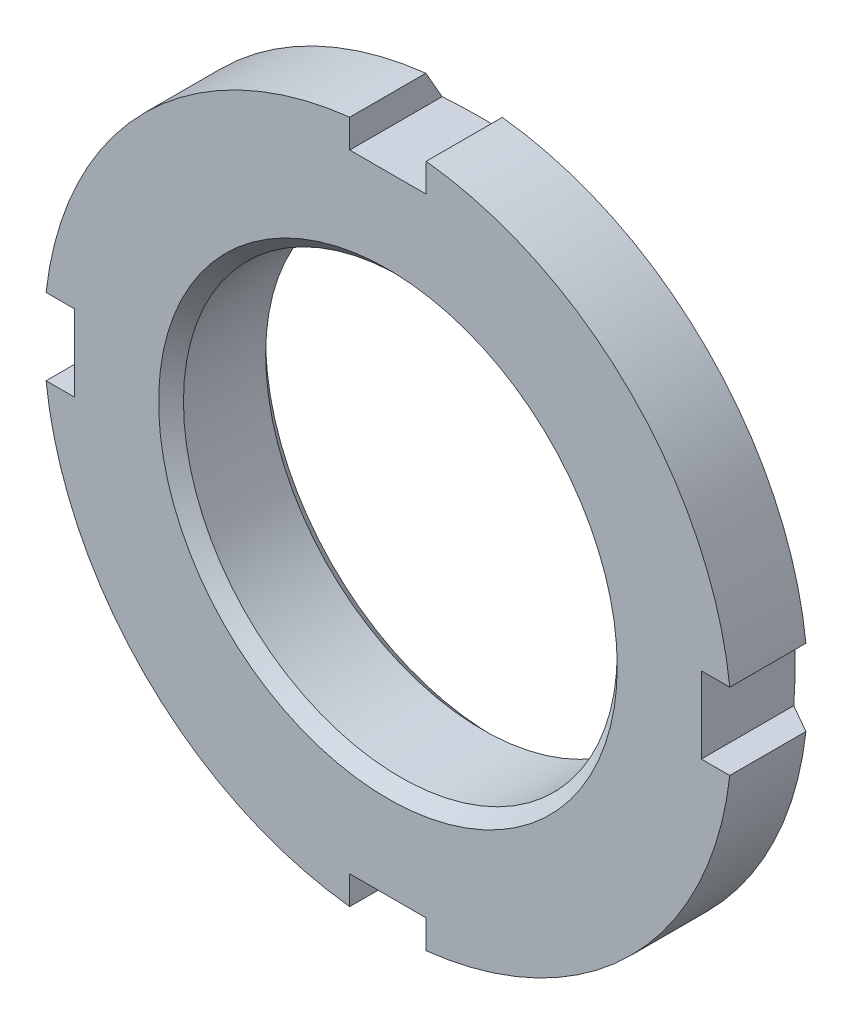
ISO-10303-21;
HEADER;
FILE_DESCRIPTION(('STEP AP214'),'2;1');
FILE_NAME('part.step','',(''),(''),'','','');
FILE_SCHEMA(('AUTOMOTIVE_DESIGN { 1 0 10303 214 1 1 1 1 }'));
ENDSEC;
DATA;
#1=APPLICATION_CONTEXT('core data for automotive mechanical design processes');
#2=APPLICATION_PROTOCOL_DEFINITION('international standard','automotive_design',2000,#1);
#3=PRODUCT_CONTEXT('',#1,'mechanical');
#4=PRODUCT('Part','Part','',(#3));
#5=PRODUCT_RELATED_PRODUCT_CATEGORY('part','',(#4));
#6=PRODUCT_DEFINITION_FORMATION('','',#4);
#7=PRODUCT_DEFINITION_CONTEXT('part definition',#1,'design');
#8=PRODUCT_DEFINITION('design','',#6,#7);
#9=PRODUCT_DEFINITION_SHAPE('','',#8);
#10=(LENGTH_UNIT() NAMED_UNIT(*) SI_UNIT(.MILLI.,.METRE.));
#11=(NAMED_UNIT(*) PLANE_ANGLE_UNIT() SI_UNIT($,.RADIAN.));
#12=(NAMED_UNIT(*) SI_UNIT($,.STERADIAN.) SOLID_ANGLE_UNIT());
#13=UNCERTAINTY_MEASURE_WITH_UNIT(LENGTH_MEASURE(1.E-05),#10,'distance_accuracy_value','');
#14=(GEOMETRIC_REPRESENTATION_CONTEXT(3) GLOBAL_UNCERTAINTY_ASSIGNED_CONTEXT((#13)) GLOBAL_UNIT_ASSIGNED_CONTEXT((#10,
#11,#12)) REPRESENTATION_CONTEXT('',''));
#15=CARTESIAN_POINT('',(0.,0.,0.));
#16=DIRECTION('',(0.,0.,1.));
#17=DIRECTION('',(1.,0.,0.));
#18=AXIS2_PLACEMENT_3D('',#15,#16,#17);
#19=CARTESIAN_POINT('',(0.,0.,-7.));
#20=DIRECTION('',(0.,0.,1.));
#21=DIRECTION('',(1.,0.,0.));
#22=AXIS2_PLACEMENT_3D('',#19,#20,#21);
#23=CYLINDRICAL_SURFACE('',#22,22.5);
#24=DIRECTION('',(0.,0.,1.));
#25=VECTOR('',#24,1.);
#26=CARTESIAN_POINT('',(-2.5,22.3606797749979,-7.));
#27=LINE('',#26,#25);
#28=CARTESIAN_POINT('',(-2.5,22.3606797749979,-4.9792740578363));
#29=VERTEX_POINT('',#28);
#30=CARTESIAN_POINT('',(-2.5,22.3606797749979,0.));
#31=VERTEX_POINT('',#30);
#32=EDGE_CURVE('E263',#29,#31,#27,.T.);
#33=ORIENTED_EDGE('',*,*,#32,.F.);
#34=CARTESIAN_POINT('',(0.,0.,-4.9792740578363));
#35=DIRECTION('',(0.,0.,1.));
#36=DIRECTION('',(1.,0.,0.));
#37=AXIS2_PLACEMENT_3D('',#34,#35,#36);
#38=CIRCLE('',#37,22.5);
#39=CARTESIAN_POINT('',(-22.3606797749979,2.5,-4.9792740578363));
#40=VERTEX_POINT('',#39);
#41=EDGE_CURVE('E271',#29,#40,#38,.T.);
#42=ORIENTED_EDGE('',*,*,#41,.T.);
#43=DIRECTION('',(0.,0.,1.));
#44=VECTOR('',#43,1.);
#45=CARTESIAN_POINT('',(-22.3606797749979,2.5,-7.));
#46=LINE('',#45,#44);
#47=CARTESIAN_POINT('',(-22.3606797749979,2.5,0.));
#48=VERTEX_POINT('',#47);
#49=EDGE_CURVE('E233',#48,#40,#46,.F.);
#50=ORIENTED_EDGE('',*,*,#49,.F.);
#51=CARTESIAN_POINT('',(0.,0.,0.));
#52=DIRECTION('',(0.,0.,1.));
#53=DIRECTION('',(1.,0.,0.));
#54=AXIS2_PLACEMENT_3D('',#51,#52,#53);
#55=CIRCLE('',#54,22.5);
#56=EDGE_CURVE('E196',#31,#48,#55,.T.);
#57=ORIENTED_EDGE('',*,*,#56,.F.);
#58=EDGE_LOOP('',(#33,#42,#50,#57));
#59=FACE_BOUND('',#58,.T.);
#60=ADVANCED_FACE('F39',(#59),#23,.T.);
#61=DIRECTION('',(0.,0.,1.));
#62=VECTOR('',#61,1.);
#63=CARTESIAN_POINT('',(2.5,22.3606797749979,-7.));
#64=LINE('',#63,#62);
#65=CARTESIAN_POINT('',(2.5,22.3606797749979,0.));
#66=VERTEX_POINT('',#65);
#67=CARTESIAN_POINT('',(2.5,22.3606797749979,-4.9792740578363));
#68=VERTEX_POINT('',#67);
#69=EDGE_CURVE('E261',#66,#68,#64,.F.);
#70=ORIENTED_EDGE('',*,*,#69,.F.);
#71=CARTESIAN_POINT('',(22.3606797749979,2.5,0.));
#72=VERTEX_POINT('',#71);
#73=EDGE_CURVE('E292',#72,#66,#55,.T.);
#74=ORIENTED_EDGE('',*,*,#73,.F.);
#75=DIRECTION('',(0.,0.,1.));
#76=VECTOR('',#75,1.);
#77=CARTESIAN_POINT('',(22.3606797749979,2.5,-7.));
#78=LINE('',#77,#76);
#79=CARTESIAN_POINT('',(22.3606797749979,2.5,-4.9792740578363));
#80=VERTEX_POINT('',#79);
#81=EDGE_CURVE('E258',#80,#72,#78,.T.);
#82=ORIENTED_EDGE('',*,*,#81,.F.);
#83=EDGE_CURVE('E266',#80,#68,#38,.T.);
#84=ORIENTED_EDGE('',*,*,#83,.T.);
#85=EDGE_LOOP('',(#70,#74,#82,#84));
#86=FACE_BOUND('',#85,.T.);
#87=ADVANCED_FACE('F452',(#86),#23,.T.);
#88=DIRECTION('',(0.,0.,1.));
#89=VECTOR('',#88,1.);
#90=CARTESIAN_POINT('',(22.3606797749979,-2.5,-7.));
#91=LINE('',#90,#89);
#92=CARTESIAN_POINT('',(22.3606797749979,-2.5,0.));
#93=VERTEX_POINT('',#92);
#94=CARTESIAN_POINT('',(22.3606797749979,-2.5,-4.9792740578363));
#95=VERTEX_POINT('',#94);
#96=EDGE_CURVE('E61',#93,#95,#91,.F.);
#97=ORIENTED_EDGE('',*,*,#96,.F.);
#98=CARTESIAN_POINT('',(2.5,-22.3606797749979,0.));
#99=VERTEX_POINT('',#98);
#100=EDGE_CURVE('E291',#99,#93,#55,.T.);
#101=ORIENTED_EDGE('',*,*,#100,.F.);
#102=DIRECTION('',(0.,0.,1.));
#103=VECTOR('',#102,1.);
#104=CARTESIAN_POINT('',(2.5,-22.3606797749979,-7.));
#105=LINE('',#104,#103);
#106=CARTESIAN_POINT('',(2.5,-22.3606797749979,-4.9792740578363));
#107=VERTEX_POINT('',#106);
#108=EDGE_CURVE('E254',#107,#99,#105,.T.);
#109=ORIENTED_EDGE('',*,*,#108,.F.);
#110=EDGE_CURVE('E265',#107,#95,#38,.T.);
#111=ORIENTED_EDGE('',*,*,#110,.T.);
#112=EDGE_LOOP('',(#97,#101,#109,#111));
#113=FACE_BOUND('',#112,.T.);
#114=ADVANCED_FACE('F429',(#113),#23,.T.);
#115=DIRECTION('',(0.,0.,1.));
#116=VECTOR('',#115,1.);
#117=CARTESIAN_POINT('',(-2.5,-22.3606797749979,-7.));
#118=LINE('',#117,#116);
#119=CARTESIAN_POINT('',(-2.5,-22.3606797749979,0.));
#120=VERTEX_POINT('',#119);
#121=CARTESIAN_POINT('',(-2.5,-22.3606797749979,-4.9792740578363));
#122=VERTEX_POINT('',#121);
#123=EDGE_CURVE('E69',#120,#122,#118,.F.);
#124=ORIENTED_EDGE('',*,*,#123,.F.);
#125=CARTESIAN_POINT('',(-22.3606797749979,-2.5,0.));
#126=VERTEX_POINT('',#125);
#127=EDGE_CURVE('E419',#126,#120,#55,.T.);
#128=ORIENTED_EDGE('',*,*,#127,.F.);
#129=DIRECTION('',(0.,0.,1.));
#130=VECTOR('',#129,1.);
#131=CARTESIAN_POINT('',(-22.3606797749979,-2.5,-7.));
#132=LINE('',#131,#130);
#133=CARTESIAN_POINT('',(-22.3606797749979,-2.5,-4.9792740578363));
#134=VERTEX_POINT('',#133);
#135=EDGE_CURVE('E250',#134,#126,#132,.T.);
#136=ORIENTED_EDGE('',*,*,#135,.F.);
#137=EDGE_CURVE('E434',#134,#122,#38,.T.);
#138=ORIENTED_EDGE('',*,*,#137,.T.);
#139=EDGE_LOOP('',(#124,#128,#136,#138));
#140=FACE_BOUND('',#139,.T.);
#141=ADVANCED_FACE('F442',(#140),#23,.T.);
#142=CARTESIAN_POINT('',(0.,22.5,0.));
#143=DIRECTION('',(0.,0.,-1.));
#144=DIRECTION('',(-1.,0.,0.));
#145=AXIS2_PLACEMENT_3D('',#142,#143,#144);
#146=PLANE('',#145);
#147=CARTESIAN_POINT('',(0.,0.,0.));
#148=DIRECTION('',(0.,0.,1.));
#149=DIRECTION('',(1.,0.,0.));
#150=AXIS2_PLACEMENT_3D('',#147,#148,#149);
#151=CIRCLE('',#150,15.);
#152=CARTESIAN_POINT('',(15.,0.,0.));
#153=VERTEX_POINT('',#152);
#154=EDGE_CURVE('E287',#153,#153,#151,.T.);
#155=ORIENTED_EDGE('',*,*,#154,.F.);
#156=EDGE_LOOP('',(#155));
#157=FACE_BOUND('',#156,.T.);
#158=DIRECTION('',(0.,1.,0.));
#159=VECTOR('',#158,1.);
#160=CARTESIAN_POINT('',(-2.5,20.5,0.));
#161=LINE('',#160,#159);
#162=CARTESIAN_POINT('',(-2.5,20.5,0.));
#163=VERTEX_POINT('',#162);
#164=EDGE_CURVE('E180',#163,#31,#161,.T.);
#165=ORIENTED_EDGE('',*,*,#164,.T.);
#166=ORIENTED_EDGE('',*,*,#56,.T.);
#167=DIRECTION('',(1.,0.,0.));
#168=VECTOR('',#167,1.);
#169=CARTESIAN_POINT('',(-34.52498880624,2.5,0.));
#170=LINE('',#169,#168);
#171=CARTESIAN_POINT('',(-20.5,2.5,0.));
#172=VERTEX_POINT('',#171);
#173=EDGE_CURVE('E172',#48,#172,#170,.T.);
#174=ORIENTED_EDGE('',*,*,#173,.T.);
#175=DIRECTION('',(0.,-1.,0.));
#176=VECTOR('',#175,1.);
#177=CARTESIAN_POINT('',(-20.5,2.5,0.));
#178=LINE('',#177,#176);
#179=CARTESIAN_POINT('',(-20.5,-2.5,0.));
#180=VERTEX_POINT('',#179);
#181=EDGE_CURVE('E183',#172,#180,#178,.T.);
#182=ORIENTED_EDGE('',*,*,#181,.T.);
#183=DIRECTION('',(-1.,0.,0.));
#184=VECTOR('',#183,1.);
#185=CARTESIAN_POINT('',(-20.5,-2.5,0.));
#186=LINE('',#185,#184);
#187=EDGE_CURVE('E190',#180,#126,#186,.T.);
#188=ORIENTED_EDGE('',*,*,#187,.T.);
#189=ORIENTED_EDGE('',*,*,#127,.T.);
#190=DIRECTION('',(0.,1.,0.));
#191=VECTOR('',#190,1.);
#192=CARTESIAN_POINT('',(-2.5,-34.52498880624,0.));
#193=LINE('',#192,#191);
#194=CARTESIAN_POINT('',(-2.5,-20.5,0.));
#195=VERTEX_POINT('',#194);
#196=EDGE_CURVE('E203',#120,#195,#193,.T.);
#197=ORIENTED_EDGE('',*,*,#196,.T.);
#198=DIRECTION('',(1.,0.,0.));
#199=VECTOR('',#198,1.);
#200=CARTESIAN_POINT('',(-2.5,-20.5,0.));
#201=LINE('',#200,#199);
#202=CARTESIAN_POINT('',(2.5,-20.5,0.));
#203=VERTEX_POINT('',#202);
#204=EDGE_CURVE('E206',#195,#203,#201,.T.);
#205=ORIENTED_EDGE('',*,*,#204,.T.);
#206=DIRECTION('',(0.,-1.,0.));
#207=VECTOR('',#206,1.);
#208=CARTESIAN_POINT('',(2.5,-20.5,0.));
#209=LINE('',#208,#207);
#210=EDGE_CURVE('E209',#203,#99,#209,.T.);
#211=ORIENTED_EDGE('',*,*,#210,.T.);
#212=ORIENTED_EDGE('',*,*,#100,.T.);
#213=DIRECTION('',(-1.,0.,0.));
#214=VECTOR('',#213,1.);
#215=CARTESIAN_POINT('',(34.52498880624,-2.5,0.));
#216=LINE('',#215,#214);
#217=CARTESIAN_POINT('',(20.5,-2.5,0.));
#218=VERTEX_POINT('',#217);
#219=EDGE_CURVE('E212',#93,#218,#216,.T.);
#220=ORIENTED_EDGE('',*,*,#219,.T.);
#221=DIRECTION('',(0.,1.,0.));
#222=VECTOR('',#221,1.);
#223=CARTESIAN_POINT('',(20.5,-2.5,0.));
#224=LINE('',#223,#222);
#225=CARTESIAN_POINT('',(20.5,2.5,0.));
#226=VERTEX_POINT('',#225);
#227=EDGE_CURVE('E216',#218,#226,#224,.T.);
#228=ORIENTED_EDGE('',*,*,#227,.T.);
#229=DIRECTION('',(1.,0.,0.));
#230=VECTOR('',#229,1.);
#231=CARTESIAN_POINT('',(20.5,2.5,0.));
#232=LINE('',#231,#230);
#233=EDGE_CURVE('E220',#226,#72,#232,.T.);
#234=ORIENTED_EDGE('',*,*,#233,.T.);
#235=ORIENTED_EDGE('',*,*,#73,.T.);
#236=DIRECTION('',(0.,-1.,0.));
#237=VECTOR('',#236,1.);
#238=CARTESIAN_POINT('',(2.5,34.52498880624,0.));
#239=LINE('',#238,#237);
#240=CARTESIAN_POINT('',(2.5,20.5,0.));
#241=VERTEX_POINT('',#240);
#242=EDGE_CURVE('E224',#66,#241,#239,.T.);
#243=ORIENTED_EDGE('',*,*,#242,.T.);
#244=DIRECTION('',(-1.,0.,0.));
#245=VECTOR('',#244,1.);
#246=CARTESIAN_POINT('',(2.5,20.5,0.));
#247=LINE('',#246,#245);
#248=EDGE_CURVE('E227',#241,#163,#247,.T.);
#249=ORIENTED_EDGE('',*,*,#248,.T.);
#250=EDGE_LOOP('',(#165,#166,#174,#182,#188,#189,#197,#205,#211,#212,#220,#228,#234,#235,#243,#249));
#251=FACE_BOUND('',#250,.T.);
#252=ADVANCED_FACE('F194',(#157,#251),#146,.F.);
#253=CARTESIAN_POINT('',(0.,0.,-7.));
#254=DIRECTION('',(0.,0.,1.));
#255=DIRECTION('',(1.,0.,0.));
#256=AXIS2_PLACEMENT_3D('',#253,#254,#255);
#257=CONICAL_SURFACE('',#256,19.,1.0471975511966);
#258=CARTESIAN_POINT('',(0.,0.,-7.));
#259=DIRECTION('',(0.,0.,1.));
#260=DIRECTION('',(1.,0.,0.));
#261=AXIS2_PLACEMENT_3D('',#258,#259,#260);
#262=CIRCLE('',#261,19.);
#263=CARTESIAN_POINT('',(19.,0.,-7.));
#264=VERTEX_POINT('',#263);
#265=EDGE_CURVE('E270',#264,#264,#262,.T.);
#266=ORIENTED_EDGE('',*,*,#265,.T.);
#267=EDGE_LOOP('',(#266));
#268=FACE_BOUND('',#267,.T.);
#269=CARTESIAN_POINT('',(-2.5,16.1512451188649,-8.53368282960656));
#270=CARTESIAN_POINT('',(-2.5,16.8937621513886,-8.11000639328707));
#271=CARTESIAN_POINT('',(-2.5,17.6360109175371,-7.68586039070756));
#272=CARTESIAN_POINT('',(-2.5,19.1200996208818,-6.83685454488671));
#273=CARTESIAN_POINT('',(-2.5,19.8619395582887,-6.41199470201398));
#274=CARTESIAN_POINT('',(-2.5,21.3453388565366,-5.56178615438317));
#275=CARTESIAN_POINT('',(-2.5,22.08689821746,-5.13643744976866));
#276=CARTESIAN_POINT('',(-2.5,23.5698031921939,-4.28536671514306));
#277=CARTESIAN_POINT('',(-2.5,24.3111488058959,-3.85964468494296));
#278=CARTESIAN_POINT('',(-2.5,25.0524204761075,-3.43379403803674));
#279=B_SPLINE_CURVE_WITH_KNOTS('',3,(#269,#270,#271,#272,#273,#274,#275,#276,#277,#278),
.UNSPECIFIED.,.F.,.F.,(4,2,2,2,4),(0.,2.56466301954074,5.12932471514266,7.69398565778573,
10.2586478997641),.UNSPECIFIED.);
#280=CARTESIAN_POINT('',(-2.5,20.5,-6.0462886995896));
#281=VERTEX_POINT('',#280);
#282=EDGE_CURVE('E11',#281,#29,#279,.T.);
#283=ORIENTED_EDGE('',*,*,#282,.F.);
#284=CARTESIAN_POINT('',(9.04404011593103,20.5,-5.03334109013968));
#285=CARTESIAN_POINT('',(8.59429321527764,20.5,-5.13815943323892));
#286=CARTESIAN_POINT('',(8.14305919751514,20.5,-5.23676310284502));
#287=CARTESIAN_POINT('',(7.23773580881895,20.5,-5.42034749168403));
#288=CARTESIAN_POINT('',(6.78364585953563,20.5,-5.50532535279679));
#289=CARTESIAN_POINT('',(5.87243627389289,20.5,-5.66050164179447));
#290=CARTESIAN_POINT('',(5.41531394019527,20.5,-5.73068433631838));
#291=CARTESIAN_POINT('',(4.49891675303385,20.5,-5.85503635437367));
#292=CARTESIAN_POINT('',(4.03964204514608,20.5,-5.90920674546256));
#293=CARTESIAN_POINT('',(3.12828446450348,20.5,-5.99971235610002));
#294=CARTESIAN_POINT('',(2.67623393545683,20.5,-6.0363717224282));
#295=CARTESIAN_POINT('',(1.7710645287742,20.5,-6.09272736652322));
#296=CARTESIAN_POINT('',(1.31794563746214,20.5,-6.11242342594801));
#297=CARTESIAN_POINT('',(0.411577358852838,20.5,-6.1344741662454));
#298=CARTESIAN_POINT('',(-0.0416717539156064,20.5,-6.13684006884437));
#299=CARTESIAN_POINT('',(-0.947924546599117,20.5,-6.12421501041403));
#300=CARTESIAN_POINT('',(-1.40092822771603,20.5,-6.10922413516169));
#301=CARTESIAN_POINT('',(-2.30461841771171,20.5,-6.06224315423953));
#302=CARTESIAN_POINT('',(-2.75530773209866,20.5,-6.03030670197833));
#303=CARTESIAN_POINT('',(-3.65521888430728,20.5,-5.95004659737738));
#304=CARTESIAN_POINT('',(-4.10444071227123,20.5,-5.90172283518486));
#305=CARTESIAN_POINT('',(-5.00125431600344,20.5,-5.78946937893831));
#306=CARTESIAN_POINT('',(-5.4488446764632,20.5,-5.72552841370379));
#307=CARTESIAN_POINT('',(-6.34170940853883,20.5,-5.58306139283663));
#308=CARTESIAN_POINT('',(-6.78698359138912,20.5,-5.50453416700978));
#309=CARTESIAN_POINT('',(-8.13663816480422,20.5,-5.24532615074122));
#310=CARTESIAN_POINT('',(-9.03699225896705,20.5,-5.04332605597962));
#311=CARTESIAN_POINT('',(-10.3777295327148,20.5,-4.7058496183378));
#312=CARTESIAN_POINT('',(-10.8226389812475,20.5,-4.58772539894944));
#313=CARTESIAN_POINT('',(-11.7094932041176,20.5,-4.34111167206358));
#314=CARTESIAN_POINT('',(-12.1514385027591,20.5,-4.212624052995));
#315=CARTESIAN_POINT('',(-12.5920022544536,20.5,-4.07950847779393));
#316=B_SPLINE_CURVE_WITH_KNOTS('',3,(#284,#285,#286,#287,#288,#289,#290,#291,#292,#293,#294,
#295,#296,#297,#298,#299,#300,#301,#302,#303,#304,#305,#306,#307,#308,#309,#310,#311,#312,#313,
#314,#315),.UNSPECIFIED.,.F.,.F.,(4,2,2,2,2,2,2,2,2,2,2,2,2,2,2,4),(0.,1.38541175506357,
2.77111373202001,4.1582819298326,5.54535762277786,6.90565342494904,8.26596673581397,
9.62539913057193,10.9848248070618,12.339971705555,13.6951276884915,15.0512646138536,
16.4075103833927,19.1739270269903,20.5548108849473,21.9354436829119),.UNSPECIFIED.);
#317=CARTESIAN_POINT('',(2.5,20.5,-6.0462886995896));
#318=VERTEX_POINT('',#317);
#319=EDGE_CURVE('E51',#318,#281,#316,.T.);
#320=ORIENTED_EDGE('',*,*,#319,.F.);
#321=CARTESIAN_POINT('',(2.5,25.0524204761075,-3.43379403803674));
#322=CARTESIAN_POINT('',(2.5,24.3111488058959,-3.85964468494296));
#323=CARTESIAN_POINT('',(2.5,23.5698031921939,-4.28536671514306));
#324=CARTESIAN_POINT('',(2.5,22.08689821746,-5.13643744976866));
#325=CARTESIAN_POINT('',(2.5,21.3453388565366,-5.56178615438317));
#326=CARTESIAN_POINT('',(2.5,19.8619395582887,-6.41199470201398));
#327=CARTESIAN_POINT('',(2.5,19.1200996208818,-6.83685454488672));
#328=CARTESIAN_POINT('',(2.5,17.6360109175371,-7.68586039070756));
#329=CARTESIAN_POINT('',(2.5,16.8937621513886,-8.11000639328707));
#330=CARTESIAN_POINT('',(2.5,16.1512451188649,-8.53368282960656));
#331=B_SPLINE_CURVE_WITH_KNOTS('',3,(#321,#322,#323,#324,#325,#326,#327,#328,#329,#330),
.UNSPECIFIED.,.F.,.F.,(4,2,2,2,4),(0.,2.56466224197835,5.12932318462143,7.69398488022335,
10.2586478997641),.UNSPECIFIED.);
#332=EDGE_CURVE('E381',#68,#318,#331,.T.);
#333=ORIENTED_EDGE('',*,*,#332,.F.);
#334=ORIENTED_EDGE('',*,*,#83,.F.);
#335=CARTESIAN_POINT('',(16.1512451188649,2.5,-8.53368282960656));
#336=CARTESIAN_POINT('',(16.8937621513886,2.5,-8.11000639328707));
#337=CARTESIAN_POINT('',(17.6360109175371,2.5,-7.68586039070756));
#338=CARTESIAN_POINT('',(19.1200996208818,2.5,-6.83685454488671));
#339=CARTESIAN_POINT('',(19.8619395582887,2.5,-6.41199470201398));
#340=CARTESIAN_POINT('',(21.3453388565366,2.5,-5.56178615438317));
#341=CARTESIAN_POINT('',(22.08689821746,2.5,-5.13643744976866));
#342=CARTESIAN_POINT('',(23.5698031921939,2.5,-4.28536671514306));
#343=CARTESIAN_POINT('',(24.3111488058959,2.5,-3.85964468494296));
#344=CARTESIAN_POINT('',(25.0524204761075,2.5,-3.43379403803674));
#345=B_SPLINE_CURVE_WITH_KNOTS('',3,(#335,#336,#337,#338,#339,#340,#341,#342,#343,#344),
.UNSPECIFIED.,.F.,.F.,(4,2,2,2,4),(0.,2.56466301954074,5.12932471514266,7.69398565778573,
10.2586478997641),.UNSPECIFIED.);
#346=CARTESIAN_POINT('',(20.5,2.5,-6.0462886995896));
#347=VERTEX_POINT('',#346);
#348=EDGE_CURVE('E375',#347,#80,#345,.T.);
#349=ORIENTED_EDGE('',*,*,#348,.F.);
#350=CARTESIAN_POINT('',(20.5,-12.5920022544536,-4.07950847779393));
#351=CARTESIAN_POINT('',(20.5,-12.1514385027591,-4.212624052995));
#352=CARTESIAN_POINT('',(20.5,-11.7094932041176,-4.34111167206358));
#353=CARTESIAN_POINT('',(20.5,-10.8226389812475,-4.58772539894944));
#354=CARTESIAN_POINT('',(20.5,-10.3777295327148,-4.7058496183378));
#355=CARTESIAN_POINT('',(20.5,-9.03699225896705,-5.04332605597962));
#356=CARTESIAN_POINT('',(20.5,-8.13663816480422,-5.24532615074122));
#357=CARTESIAN_POINT('',(20.5,-6.78698359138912,-5.50453416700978));
#358=CARTESIAN_POINT('',(20.5,-6.34170940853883,-5.58306139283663));
#359=CARTESIAN_POINT('',(20.5,-5.4488446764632,-5.72552841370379));
#360=CARTESIAN_POINT('',(20.5,-5.00125431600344,-5.78946937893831));
#361=CARTESIAN_POINT('',(20.5,-4.10444071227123,-5.90172283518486));
#362=CARTESIAN_POINT('',(20.5,-3.65521888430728,-5.95004659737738));
#363=CARTESIAN_POINT('',(20.5,-2.75530773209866,-6.03030670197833));
#364=CARTESIAN_POINT('',(20.5,-2.3046184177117,-6.06224315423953));
#365=CARTESIAN_POINT('',(20.5,-1.40092822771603,-6.10922413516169));
#366=CARTESIAN_POINT('',(20.5,-0.947924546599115,-6.12421501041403));
#367=CARTESIAN_POINT('',(20.5,-0.0416717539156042,-6.13684006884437));
#368=CARTESIAN_POINT('',(20.5,0.41157735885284,-6.1344741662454));
#369=CARTESIAN_POINT('',(20.5,1.31794563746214,-6.11242342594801));
#370=CARTESIAN_POINT('',(20.5,1.7710645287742,-6.09272736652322));
#371=CARTESIAN_POINT('',(20.5,2.67623393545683,-6.0363717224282));
#372=CARTESIAN_POINT('',(20.5,3.12828446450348,-5.99971235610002));
#373=CARTESIAN_POINT('',(20.5,4.03964204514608,-5.90920674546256));
#374=CARTESIAN_POINT('',(20.5,4.49891675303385,-5.85503635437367));
#375=CARTESIAN_POINT('',(20.5,5.41531394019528,-5.73068433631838));
#376=CARTESIAN_POINT('',(20.5,5.87243627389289,-5.66050164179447));
#377=CARTESIAN_POINT('',(20.5,6.78364585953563,-5.50532535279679));
#378=CARTESIAN_POINT('',(20.5,7.23773580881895,-5.42034749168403));
#379=CARTESIAN_POINT('',(20.5,8.14305919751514,-5.23676310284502));
#380=CARTESIAN_POINT('',(20.5,8.59429321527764,-5.13815943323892));
#381=CARTESIAN_POINT('',(20.5,9.04404011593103,-5.03334109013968));
#382=B_SPLINE_CURVE_WITH_KNOTS('',3,(#350,#351,#352,#353,#354,#355,#356,#357,#358,#359,#360,
#361,#362,#363,#364,#365,#366,#367,#368,#369,#370,#371,#372,#373,#374,#375,#376,#377,#378,#379,
#380,#381),.UNSPECIFIED.,.F.,.F.,(4,2,2,2,2,2,2,2,2,2,2,2,2,2,2,4),(0.,1.3806327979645,
2.7615166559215,5.52793329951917,6.88417906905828,8.24031599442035,9.5954719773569,
10.95061887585,12.3100445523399,13.6694769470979,15.0297902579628,16.390086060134,
17.7771617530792,19.1643299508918,20.5500319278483,21.9354436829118),.UNSPECIFIED.);
#383=CARTESIAN_POINT('',(20.5,-2.5,-6.0462886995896));
#384=VERTEX_POINT('',#383);
#385=EDGE_CURVE('E369',#384,#347,#382,.T.);
#386=ORIENTED_EDGE('',*,*,#385,.F.);
#387=CARTESIAN_POINT('',(25.0524204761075,-2.5,-3.43379403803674));
#388=CARTESIAN_POINT('',(24.3111488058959,-2.5,-3.85964468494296));
#389=CARTESIAN_POINT('',(23.5698031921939,-2.5,-4.28536671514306));
#390=CARTESIAN_POINT('',(22.08689821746,-2.5,-5.13643744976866));
#391=CARTESIAN_POINT('',(21.3453388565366,-2.5,-5.56178615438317));
#392=CARTESIAN_POINT('',(19.8619395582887,-2.5,-6.41199470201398));
#393=CARTESIAN_POINT('',(19.1200996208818,-2.5,-6.83685454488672));
#394=CARTESIAN_POINT('',(17.6360109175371,-2.5,-7.68586039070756));
#395=CARTESIAN_POINT('',(16.8937621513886,-2.5,-8.11000639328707));
#396=CARTESIAN_POINT('',(16.1512451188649,-2.5,-8.53368282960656));
#397=B_SPLINE_CURVE_WITH_KNOTS('',3,(#387,#388,#389,#390,#391,#392,#393,#394,#395,#396),
.UNSPECIFIED.,.F.,.F.,(4,2,2,2,4),(0.,2.56466224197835,5.12932318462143,7.69398488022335,
10.2586478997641),.UNSPECIFIED.);
#398=EDGE_CURVE('E363',#95,#384,#397,.T.);
#399=ORIENTED_EDGE('',*,*,#398,.F.);
#400=ORIENTED_EDGE('',*,*,#110,.F.);
#401=CARTESIAN_POINT('',(2.5,-16.1512451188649,-8.53368282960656));
#402=CARTESIAN_POINT('',(2.5,-16.8937621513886,-8.11000639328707));
#403=CARTESIAN_POINT('',(2.5,-17.6360109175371,-7.68586039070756));
#404=CARTESIAN_POINT('',(2.5,-19.1200996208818,-6.83685454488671));
#405=CARTESIAN_POINT('',(2.5,-19.8619395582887,-6.41199470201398));
#406=CARTESIAN_POINT('',(2.5,-21.3453388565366,-5.56178615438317));
#407=CARTESIAN_POINT('',(2.5,-22.08689821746,-5.13643744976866));
#408=CARTESIAN_POINT('',(2.5,-23.5698031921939,-4.28536671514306));
#409=CARTESIAN_POINT('',(2.5,-24.3111488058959,-3.85964468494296));
#410=CARTESIAN_POINT('',(2.5,-25.0524204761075,-3.43379403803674));
#411=B_SPLINE_CURVE_WITH_KNOTS('',3,(#401,#402,#403,#404,#405,#406,#407,#408,#409,#410),
.UNSPECIFIED.,.F.,.F.,(4,2,2,2,4),(0.,2.56466301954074,5.12932471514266,7.69398565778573,
10.2586478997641),.UNSPECIFIED.);
#412=CARTESIAN_POINT('',(2.5,-20.5,-6.0462886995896));
#413=VERTEX_POINT('',#412);
#414=EDGE_CURVE('E341',#413,#107,#411,.T.);
#415=ORIENTED_EDGE('',*,*,#414,.F.);
#416=CARTESIAN_POINT('',(-12.5920022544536,-20.5,-4.07950847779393));
#417=CARTESIAN_POINT('',(-12.1514385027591,-20.5,-4.212624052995));
#418=CARTESIAN_POINT('',(-11.7094932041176,-20.5,-4.34111167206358));
#419=CARTESIAN_POINT('',(-10.8226389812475,-20.5,-4.58772539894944));
#420=CARTESIAN_POINT('',(-10.3777295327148,-20.5,-4.7058496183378));
#421=CARTESIAN_POINT('',(-9.03699225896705,-20.5,-5.04332605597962));
#422=CARTESIAN_POINT('',(-8.13663816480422,-20.5,-5.24532615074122));
#423=CARTESIAN_POINT('',(-6.78698359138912,-20.5,-5.50453416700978));
#424=CARTESIAN_POINT('',(-6.34170940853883,-20.5,-5.58306139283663));
#425=CARTESIAN_POINT('',(-5.4488446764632,-20.5,-5.72552841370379));
#426=CARTESIAN_POINT('',(-5.00125431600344,-20.5,-5.78946937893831));
#427=CARTESIAN_POINT('',(-4.10444071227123,-20.5,-5.90172283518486));
#428=CARTESIAN_POINT('',(-3.65521888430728,-20.5,-5.95004659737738));
#429=CARTESIAN_POINT('',(-2.75530773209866,-20.5,-6.03030670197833));
#430=CARTESIAN_POINT('',(-2.3046184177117,-20.5,-6.06224315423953));
#431=CARTESIAN_POINT('',(-1.40092822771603,-20.5,-6.10922413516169));
#432=CARTESIAN_POINT('',(-0.947924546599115,-20.5,-6.12421501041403));
#433=CARTESIAN_POINT('',(-0.0416717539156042,-20.5,-6.13684006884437));
#434=CARTESIAN_POINT('',(0.41157735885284,-20.5,-6.1344741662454));
#435=CARTESIAN_POINT('',(1.31794563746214,-20.5,-6.11242342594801));
#436=CARTESIAN_POINT('',(1.7710645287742,-20.5,-6.09272736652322));
#437=CARTESIAN_POINT('',(2.67623393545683,-20.5,-6.0363717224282));
#438=CARTESIAN_POINT('',(3.12828446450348,-20.5,-5.99971235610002));
#439=CARTESIAN_POINT('',(4.03964204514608,-20.5,-5.90920674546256));
#440=CARTESIAN_POINT('',(4.49891675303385,-20.5,-5.85503635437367));
#441=CARTESIAN_POINT('',(5.41531394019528,-20.5,-5.73068433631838));
#442=CARTESIAN_POINT('',(5.87243627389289,-20.5,-5.66050164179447));
#443=CARTESIAN_POINT('',(6.78364585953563,-20.5,-5.50532535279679));
#444=CARTESIAN_POINT('',(7.23773580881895,-20.5,-5.42034749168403));
#445=CARTESIAN_POINT('',(8.14305919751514,-20.5,-5.23676310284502));
#446=CARTESIAN_POINT('',(8.59429321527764,-20.5,-5.13815943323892));
#447=CARTESIAN_POINT('',(9.04404011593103,-20.5,-5.03334109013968));
#448=B_SPLINE_CURVE_WITH_KNOTS('',3,(#416,#417,#418,#419,#420,#421,#422,#423,#424,#425,#426,
#427,#428,#429,#430,#431,#432,#433,#434,#435,#436,#437,#438,#439,#440,#441,#442,#443,#444,#445,
#446,#447),.UNSPECIFIED.,.F.,.F.,(4,2,2,2,2,2,2,2,2,2,2,2,2,2,2,4),(0.,1.3806327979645,
2.7615166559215,5.52793329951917,6.88417906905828,8.24031599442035,9.5954719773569,
10.95061887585,12.3100445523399,13.6694769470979,15.0297902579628,16.390086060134,
17.7771617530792,19.1643299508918,20.5500319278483,21.9354436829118),.UNSPECIFIED.);
#449=CARTESIAN_POINT('',(-2.5,-20.5,-6.0462886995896));
#450=VERTEX_POINT('',#449);
#451=EDGE_CURVE('E336',#450,#413,#448,.T.);
#452=ORIENTED_EDGE('',*,*,#451,.F.);
#453=CARTESIAN_POINT('',(-2.5,-25.0524204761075,-3.43379403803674));
#454=CARTESIAN_POINT('',(-2.5,-24.3111488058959,-3.85964468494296));
#455=CARTESIAN_POINT('',(-2.5,-23.5698031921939,-4.28536671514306));
#456=CARTESIAN_POINT('',(-2.5,-22.08689821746,-5.13643744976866));
#457=CARTESIAN_POINT('',(-2.5,-21.3453388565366,-5.56178615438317));
#458=CARTESIAN_POINT('',(-2.5,-19.8619395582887,-6.41199470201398));
#459=CARTESIAN_POINT('',(-2.5,-19.1200996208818,-6.83685454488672));
#460=CARTESIAN_POINT('',(-2.5,-17.6360109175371,-7.68586039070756));
#461=CARTESIAN_POINT('',(-2.5,-16.8937621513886,-8.11000639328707));
#462=CARTESIAN_POINT('',(-2.5,-16.1512451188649,-8.53368282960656));
#463=B_SPLINE_CURVE_WITH_KNOTS('',3,(#453,#454,#455,#456,#457,#458,#459,#460,#461,#462),
.UNSPECIFIED.,.F.,.F.,(4,2,2,2,4),(0.,2.56466224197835,5.12932318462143,7.69398488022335,
10.2586478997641),.UNSPECIFIED.);
#464=EDGE_CURVE('E331',#122,#450,#463,.T.);
#465=ORIENTED_EDGE('',*,*,#464,.F.);
#466=ORIENTED_EDGE('',*,*,#137,.F.);
#467=CARTESIAN_POINT('',(-16.1512451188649,-2.5,-8.53368282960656));
#468=CARTESIAN_POINT('',(-16.8937621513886,-2.5,-8.11000639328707));
#469=CARTESIAN_POINT('',(-17.6360109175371,-2.5,-7.68586039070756));
#470=CARTESIAN_POINT('',(-19.1200996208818,-2.5,-6.83685454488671));
#471=CARTESIAN_POINT('',(-19.8619395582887,-2.5,-6.41199470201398));
#472=CARTESIAN_POINT('',(-21.3453388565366,-2.5,-5.56178615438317));
#473=CARTESIAN_POINT('',(-22.08689821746,-2.5,-5.13643744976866));
#474=CARTESIAN_POINT('',(-23.5698031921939,-2.5,-4.28536671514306));
#475=CARTESIAN_POINT('',(-24.3111488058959,-2.5,-3.85964468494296));
#476=CARTESIAN_POINT('',(-25.0524204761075,-2.5,-3.43379403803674));
#477=B_SPLINE_CURVE_WITH_KNOTS('',3,(#467,#468,#469,#470,#471,#472,#473,#474,#475,#476),
.UNSPECIFIED.,.F.,.F.,(4,2,2,2,4),(0.,2.56466301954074,5.12932471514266,7.69398565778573,
10.2586478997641),.UNSPECIFIED.);
#478=CARTESIAN_POINT('',(-20.5,-2.5,-6.0462886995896));
#479=VERTEX_POINT('',#478);
#480=EDGE_CURVE('E325',#479,#134,#477,.T.);
#481=ORIENTED_EDGE('',*,*,#480,.F.);
#482=CARTESIAN_POINT('',(-20.5,9.04404011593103,-5.03334109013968));
#483=CARTESIAN_POINT('',(-20.5,8.59429321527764,-5.13815943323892));
#484=CARTESIAN_POINT('',(-20.5,8.14305919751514,-5.23676310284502));
#485=CARTESIAN_POINT('',(-20.5,7.23773580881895,-5.42034749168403));
#486=CARTESIAN_POINT('',(-20.5,6.78364585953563,-5.50532535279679));
#487=CARTESIAN_POINT('',(-20.5,5.87243627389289,-5.66050164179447));
#488=CARTESIAN_POINT('',(-20.5,5.41531394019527,-5.73068433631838));
#489=CARTESIAN_POINT('',(-20.5,4.49891675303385,-5.85503635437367));
#490=CARTESIAN_POINT('',(-20.5,4.03964204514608,-5.90920674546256));
#491=CARTESIAN_POINT('',(-20.5,3.12828446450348,-5.99971235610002));
#492=CARTESIAN_POINT('',(-20.5,2.67623393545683,-6.0363717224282));
#493=CARTESIAN_POINT('',(-20.5,1.7710645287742,-6.09272736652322));
#494=CARTESIAN_POINT('',(-20.5,1.31794563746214,-6.11242342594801));
#495=CARTESIAN_POINT('',(-20.5,0.411577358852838,-6.1344741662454));
#496=CARTESIAN_POINT('',(-20.5,-0.0416717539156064,-6.13684006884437));
#497=CARTESIAN_POINT('',(-20.5,-0.947924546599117,-6.12421501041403));
#498=CARTESIAN_POINT('',(-20.5,-1.40092822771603,-6.10922413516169));
#499=CARTESIAN_POINT('',(-20.5,-2.30461841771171,-6.06224315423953));
#500=CARTESIAN_POINT('',(-20.5,-2.75530773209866,-6.03030670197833));
#501=CARTESIAN_POINT('',(-20.5,-3.65521888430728,-5.95004659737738));
#502=CARTESIAN_POINT('',(-20.5,-4.10444071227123,-5.90172283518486));
#503=CARTESIAN_POINT('',(-20.5,-5.00125431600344,-5.78946937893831));
#504=CARTESIAN_POINT('',(-20.5,-5.4488446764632,-5.72552841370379));
#505=CARTESIAN_POINT('',(-20.5,-6.34170940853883,-5.58306139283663));
#506=CARTESIAN_POINT('',(-20.5,-6.78698359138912,-5.50453416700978));
#507=CARTESIAN_POINT('',(-20.5,-8.13663816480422,-5.24532615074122));
#508=CARTESIAN_POINT('',(-20.5,-9.03699225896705,-5.04332605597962));
#509=CARTESIAN_POINT('',(-20.5,-10.3777295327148,-4.7058496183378));
#510=CARTESIAN_POINT('',(-20.5,-10.8226389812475,-4.58772539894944));
#511=CARTESIAN_POINT('',(-20.5,-11.7094932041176,-4.34111167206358));
#512=CARTESIAN_POINT('',(-20.5,-12.1514385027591,-4.212624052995));
#513=CARTESIAN_POINT('',(-20.5,-12.5920022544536,-4.07950847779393));
#514=B_SPLINE_CURVE_WITH_KNOTS('',3,(#482,#483,#484,#485,#486,#487,#488,#489,#490,#491,#492,
#493,#494,#495,#496,#497,#498,#499,#500,#501,#502,#503,#504,#505,#506,#507,#508,#509,#510,#511,
#512,#513),.UNSPECIFIED.,.F.,.F.,(4,2,2,2,2,2,2,2,2,2,2,2,2,2,2,4),(0.,1.38541175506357,
2.77111373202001,4.1582819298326,5.54535762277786,6.90565342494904,8.26596673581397,
9.62539913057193,10.9848248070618,12.339971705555,13.6951276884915,15.0512646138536,
16.4075103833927,19.1739270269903,20.5548108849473,21.9354436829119),.UNSPECIFIED.);
#515=CARTESIAN_POINT('',(-20.5,2.5,-6.0462886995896));
#516=VERTEX_POINT('',#515);
#517=EDGE_CURVE('E302',#516,#479,#514,.T.);
#518=ORIENTED_EDGE('',*,*,#517,.F.);
#519=CARTESIAN_POINT('',(-25.0524204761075,2.5,-3.43379403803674));
#520=CARTESIAN_POINT('',(-24.3111488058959,2.5,-3.85964468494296));
#521=CARTESIAN_POINT('',(-23.5698031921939,2.5,-4.28536671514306));
#522=CARTESIAN_POINT('',(-22.08689821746,2.5,-5.13643744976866));
#523=CARTESIAN_POINT('',(-21.3453388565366,2.5,-5.56178615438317));
#524=CARTESIAN_POINT('',(-19.8619395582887,2.5,-6.41199470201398));
#525=CARTESIAN_POINT('',(-19.1200996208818,2.5,-6.83685454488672));
#526=CARTESIAN_POINT('',(-17.6360109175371,2.5,-7.68586039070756));
#527=CARTESIAN_POINT('',(-16.8937621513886,2.5,-8.11000639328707));
#528=CARTESIAN_POINT('',(-16.1512451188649,2.5,-8.53368282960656));
#529=B_SPLINE_CURVE_WITH_KNOTS('',3,(#519,#520,#521,#522,#523,#524,#525,#526,#527,#528),
.UNSPECIFIED.,.F.,.F.,(4,2,2,2,4),(0.,2.56466224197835,5.12932318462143,7.69398488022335,
10.2586478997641),.UNSPECIFIED.);
#530=EDGE_CURVE('E175',#40,#516,#529,.T.);
#531=ORIENTED_EDGE('',*,*,#530,.F.);
#532=ORIENTED_EDGE('',*,*,#41,.F.);
#533=EDGE_LOOP('',(#283,#320,#333,#334,#349,#386,#399,#400,#415,#452,#465,#466,#481,#518,#531,#532));
#534=FACE_BOUND('',#533,.T.);
#535=ADVANCED_FACE('F308',(#268,#534),#257,.T.);
#536=CARTESIAN_POINT('',(0.,0.,0.));
#537=DIRECTION('',(0.,0.,1.));
#538=DIRECTION('',(1.,0.,0.));
#539=AXIS2_PLACEMENT_3D('',#536,#537,#538);
#540=CONICAL_SURFACE('',#539,15.,0.785398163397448);
#541=CARTESIAN_POINT('',(0.,0.,-0.812));
#542=DIRECTION('',(0.,0.,1.));
#543=DIRECTION('',(1.,0.,0.));
#544=AXIS2_PLACEMENT_3D('',#541,#542,#543);
#545=CIRCLE('',#544,14.188);
#546=CARTESIAN_POINT('',(14.188,0.,-0.812));
#547=VERTEX_POINT('',#546);
#548=EDGE_CURVE('E283',#547,#547,#545,.T.);
#549=ORIENTED_EDGE('',*,*,#548,.F.);
#550=EDGE_LOOP('',(#549));
#551=FACE_BOUND('',#550,.T.);
#552=ORIENTED_EDGE('',*,*,#154,.T.);
#553=EDGE_LOOP('',(#552));
#554=FACE_BOUND('',#553,.T.);
#555=ADVANCED_FACE('F478',(#551,#554),#540,.F.);
#556=CARTESIAN_POINT('',(0.,0.,-7.));
#557=DIRECTION('',(0.,0.,1.));
#558=DIRECTION('',(1.,0.,0.));
#559=AXIS2_PLACEMENT_3D('',#556,#557,#558);
#560=CYLINDRICAL_SURFACE('',#559,14.188);
#561=CARTESIAN_POINT('',(0.,0.,-6.188));
#562=DIRECTION('',(0.,0.,1.));
#563=DIRECTION('',(1.,0.,0.));
#564=AXIS2_PLACEMENT_3D('',#561,#562,#563);
#565=CIRCLE('',#564,14.188);
#566=CARTESIAN_POINT('',(14.188,0.,-6.188));
#567=VERTEX_POINT('',#566);
#568=EDGE_CURVE('E279',#567,#567,#565,.T.);
#569=ORIENTED_EDGE('',*,*,#568,.F.);
#570=EDGE_LOOP('',(#569));
#571=FACE_BOUND('',#570,.T.);
#572=ORIENTED_EDGE('',*,*,#548,.T.);
#573=EDGE_LOOP('',(#572));
#574=FACE_BOUND('',#573,.T.);
#575=ADVANCED_FACE('F473',(#571,#574),#560,.F.);
#576=CARTESIAN_POINT('',(0.,0.,-6.188));
#577=DIRECTION('',(0.,0.,-1.));
#578=DIRECTION('',(-1.,0.,0.));
#579=AXIS2_PLACEMENT_3D('',#576,#577,#578);
#580=CONICAL_SURFACE('',#579,14.188,0.785398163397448);
#581=CARTESIAN_POINT('',(0.,0.,-7.));
#582=DIRECTION('',(0.,0.,1.));
#583=DIRECTION('',(1.,0.,0.));
#584=AXIS2_PLACEMENT_3D('',#581,#582,#583);
#585=CIRCLE('',#584,15.);
#586=CARTESIAN_POINT('',(15.,0.,-7.));
#587=VERTEX_POINT('',#586);
#588=EDGE_CURVE('E275',#587,#587,#585,.T.);
#589=ORIENTED_EDGE('',*,*,#588,.F.);
#590=EDGE_LOOP('',(#589));
#591=FACE_BOUND('',#590,.T.);
#592=ORIENTED_EDGE('',*,*,#568,.T.);
#593=EDGE_LOOP('',(#592));
#594=FACE_BOUND('',#593,.T.);
#595=ADVANCED_FACE('F477',(#591,#594),#580,.F.);
#596=CARTESIAN_POINT('',(0.,15.,-7.));
#597=DIRECTION('',(0.,0.,1.));
#598=DIRECTION('',(1.,0.,0.));
#599=AXIS2_PLACEMENT_3D('',#596,#597,#598);
#600=PLANE('',#599);
#601=ORIENTED_EDGE('',*,*,#265,.F.);
#602=EDGE_LOOP('',(#601));
#603=FACE_BOUND('',#602,.T.);
#604=ORIENTED_EDGE('',*,*,#588,.T.);
#605=EDGE_LOOP('',(#604));
#606=FACE_BOUND('',#605,.T.);
#607=ADVANCED_FACE('F313',(#603,#606),#600,.F.);
#608=CARTESIAN_POINT('',(-34.52498880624,2.5,-7.));
#609=DIRECTION('',(0.,-1.,0.));
#610=DIRECTION('',(0.,0.,-1.));
#611=AXIS2_PLACEMENT_3D('',#608,#609,#610);
#612=PLANE('',#611);
#613=ORIENTED_EDGE('',*,*,#49,.T.);
#614=ORIENTED_EDGE('',*,*,#530,.T.);
#615=DIRECTION('',(0.,0.,1.));
#616=VECTOR('',#615,1.);
#617=CARTESIAN_POINT('',(-20.5,2.5,-7.));
#618=LINE('',#617,#616);
#619=EDGE_CURVE('E168',#516,#172,#618,.T.);
#620=ORIENTED_EDGE('',*,*,#619,.T.);
#621=ORIENTED_EDGE('',*,*,#173,.F.);
#622=EDGE_LOOP('',(#613,#614,#620,#621));
#623=FACE_BOUND('',#622,.T.);
#624=ADVANCED_FACE('F170',(#623),#612,.T.);
#625=CARTESIAN_POINT('',(-20.5,2.5,-7.));
#626=DIRECTION('',(-1.,0.,0.));
#627=DIRECTION('',(0.,0.,1.));
#628=AXIS2_PLACEMENT_3D('',#625,#626,#627);
#629=PLANE('',#628);
#630=ORIENTED_EDGE('',*,*,#517,.T.);
#631=DIRECTION('',(0.,0.,1.));
#632=VECTOR('',#631,1.);
#633=CARTESIAN_POINT('',(-20.5,-2.5,-7.));
#634=LINE('',#633,#632);
#635=EDGE_CURVE('E179',#479,#180,#634,.T.);
#636=ORIENTED_EDGE('',*,*,#635,.T.);
#637=ORIENTED_EDGE('',*,*,#181,.F.);
#638=ORIENTED_EDGE('',*,*,#619,.F.);
#639=EDGE_LOOP('',(#630,#636,#637,#638));
#640=FACE_BOUND('',#639,.T.);
#641=ADVANCED_FACE('F184',(#640),#629,.T.);
#642=CARTESIAN_POINT('',(-20.5,-2.5,-7.));
#643=DIRECTION('',(0.,1.,0.));
#644=DIRECTION('',(0.,0.,1.));
#645=AXIS2_PLACEMENT_3D('',#642,#643,#644);
#646=PLANE('',#645);
#647=ORIENTED_EDGE('',*,*,#135,.T.);
#648=ORIENTED_EDGE('',*,*,#187,.F.);
#649=ORIENTED_EDGE('',*,*,#635,.F.);
#650=ORIENTED_EDGE('',*,*,#480,.T.);
#651=EDGE_LOOP('',(#647,#648,#649,#650));
#652=FACE_BOUND('',#651,.T.);
#653=ADVANCED_FACE('F317',(#652),#646,.T.);
#654=CARTESIAN_POINT('',(-2.5,-34.52498880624,-7.));
#655=DIRECTION('',(1.,0.,0.));
#656=DIRECTION('',(0.,0.,-1.));
#657=AXIS2_PLACEMENT_3D('',#654,#655,#656);
#658=PLANE('',#657);
#659=ORIENTED_EDGE('',*,*,#123,.T.);
#660=ORIENTED_EDGE('',*,*,#464,.T.);
#661=DIRECTION('',(0.,0.,1.));
#662=VECTOR('',#661,1.);
#663=CARTESIAN_POINT('',(-2.5,-20.5,-7.));
#664=LINE('',#663,#662);
#665=EDGE_CURVE('E244',#450,#195,#664,.T.);
#666=ORIENTED_EDGE('',*,*,#665,.T.);
#667=ORIENTED_EDGE('',*,*,#196,.F.);
#668=EDGE_LOOP('',(#659,#660,#666,#667));
#669=FACE_BOUND('',#668,.T.);
#670=ADVANCED_FACE('F321',(#669),#658,.T.);
#671=CARTESIAN_POINT('',(-2.5,-20.5,-7.));
#672=DIRECTION('',(0.,-1.,0.));
#673=DIRECTION('',(0.,0.,-1.));
#674=AXIS2_PLACEMENT_3D('',#671,#672,#673);
#675=PLANE('',#674);
#676=ORIENTED_EDGE('',*,*,#451,.T.);
#677=DIRECTION('',(0.,0.,1.));
#678=VECTOR('',#677,1.);
#679=CARTESIAN_POINT('',(2.5,-20.5,-7.));
#680=LINE('',#679,#678);
#681=EDGE_CURVE('E242',#413,#203,#680,.T.);
#682=ORIENTED_EDGE('',*,*,#681,.T.);
#683=ORIENTED_EDGE('',*,*,#204,.F.);
#684=ORIENTED_EDGE('',*,*,#665,.F.);
#685=EDGE_LOOP('',(#676,#682,#683,#684));
#686=FACE_BOUND('',#685,.T.);
#687=ADVANCED_FACE('F347',(#686),#675,.T.);
#688=CARTESIAN_POINT('',(2.5,-20.5,-7.));
#689=DIRECTION('',(-1.,0.,0.));
#690=DIRECTION('',(0.,0.,1.));
#691=AXIS2_PLACEMENT_3D('',#688,#689,#690);
#692=PLANE('',#691);
#693=ORIENTED_EDGE('',*,*,#108,.T.);
#694=ORIENTED_EDGE('',*,*,#210,.F.);
#695=ORIENTED_EDGE('',*,*,#681,.F.);
#696=ORIENTED_EDGE('',*,*,#414,.T.);
#697=EDGE_LOOP('',(#693,#694,#695,#696));
#698=FACE_BOUND('',#697,.T.);
#699=ADVANCED_FACE('F350',(#698),#692,.T.);
#700=CARTESIAN_POINT('',(34.52498880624,-2.5,-7.));
#701=DIRECTION('',(0.,1.,0.));
#702=DIRECTION('',(0.,0.,1.));
#703=AXIS2_PLACEMENT_3D('',#700,#701,#702);
#704=PLANE('',#703);
#705=ORIENTED_EDGE('',*,*,#96,.T.);
#706=ORIENTED_EDGE('',*,*,#398,.T.);
#707=DIRECTION('',(0.,0.,1.));
#708=VECTOR('',#707,1.);
#709=CARTESIAN_POINT('',(20.5,-2.5,-7.));
#710=LINE('',#709,#708);
#711=EDGE_CURVE('E239',#384,#218,#710,.T.);
#712=ORIENTED_EDGE('',*,*,#711,.T.);
#713=ORIENTED_EDGE('',*,*,#219,.F.);
#714=EDGE_LOOP('',(#705,#706,#712,#713));
#715=FACE_BOUND('',#714,.T.);
#716=ADVANCED_FACE('F355',(#715),#704,.T.);
#717=CARTESIAN_POINT('',(20.5,-2.5,-7.));
#718=DIRECTION('',(1.,0.,0.));
#719=DIRECTION('',(0.,0.,-1.));
#720=AXIS2_PLACEMENT_3D('',#717,#718,#719);
#721=PLANE('',#720);
#722=ORIENTED_EDGE('',*,*,#385,.T.);
#723=DIRECTION('',(0.,0.,1.));
#724=VECTOR('',#723,1.);
#725=CARTESIAN_POINT('',(20.5,2.5,-7.));
#726=LINE('',#725,#724);
#727=EDGE_CURVE('E236',#347,#226,#726,.T.);
#728=ORIENTED_EDGE('',*,*,#727,.T.);
#729=ORIENTED_EDGE('',*,*,#227,.F.);
#730=ORIENTED_EDGE('',*,*,#711,.F.);
#731=EDGE_LOOP('',(#722,#728,#729,#730));
#732=FACE_BOUND('',#731,.T.);
#733=ADVANCED_FACE('F360',(#732),#721,.T.);
#734=CARTESIAN_POINT('',(20.5,2.5,-7.));
#735=DIRECTION('',(0.,-1.,0.));
#736=DIRECTION('',(0.,0.,-1.));
#737=AXIS2_PLACEMENT_3D('',#734,#735,#736);
#738=PLANE('',#737);
#739=ORIENTED_EDGE('',*,*,#81,.T.);
#740=ORIENTED_EDGE('',*,*,#233,.F.);
#741=ORIENTED_EDGE('',*,*,#727,.F.);
#742=ORIENTED_EDGE('',*,*,#348,.T.);
#743=EDGE_LOOP('',(#739,#740,#741,#742));
#744=FACE_BOUND('',#743,.T.);
#745=ADVANCED_FACE('F386',(#744),#738,.T.);
#746=CARTESIAN_POINT('',(-2.5,20.5,-7.));
#747=DIRECTION('',(1.,0.,0.));
#748=DIRECTION('',(0.,0.,-1.));
#749=AXIS2_PLACEMENT_3D('',#746,#747,#748);
#750=PLANE('',#749);
#751=ORIENTED_EDGE('',*,*,#32,.T.);
#752=ORIENTED_EDGE('',*,*,#164,.F.);
#753=DIRECTION('',(0.,0.,1.));
#754=VECTOR('',#753,1.);
#755=CARTESIAN_POINT('',(-2.5,20.5,-7.));
#756=LINE('',#755,#754);
#757=EDGE_CURVE('E231',#281,#163,#756,.T.);
#758=ORIENTED_EDGE('',*,*,#757,.F.);
#759=ORIENTED_EDGE('',*,*,#282,.T.);
#760=EDGE_LOOP('',(#751,#752,#758,#759));
#761=FACE_BOUND('',#760,.T.);
#762=ADVANCED_FACE('F389',(#761),#750,.T.);
#763=CARTESIAN_POINT('',(2.5,20.5,-7.));
#764=DIRECTION('',(0.,1.,0.));
#765=DIRECTION('',(0.,0.,1.));
#766=AXIS2_PLACEMENT_3D('',#763,#764,#765);
#767=PLANE('',#766);
#768=ORIENTED_EDGE('',*,*,#319,.T.);
#769=ORIENTED_EDGE('',*,*,#757,.T.);
#770=ORIENTED_EDGE('',*,*,#248,.F.);
#771=DIRECTION('',(0.,0.,1.));
#772=VECTOR('',#771,1.);
#773=CARTESIAN_POINT('',(2.5,20.5,-7.));
#774=LINE('',#773,#772);
#775=EDGE_CURVE('E234',#318,#241,#774,.T.);
#776=ORIENTED_EDGE('',*,*,#775,.F.);
#777=EDGE_LOOP('',(#768,#769,#770,#776));
#778=FACE_BOUND('',#777,.T.);
#779=ADVANCED_FACE('F395',(#778),#767,.T.);
#780=CARTESIAN_POINT('',(2.5,34.52498880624,-7.));
#781=DIRECTION('',(-1.,0.,0.));
#782=DIRECTION('',(0.,0.,1.));
#783=AXIS2_PLACEMENT_3D('',#780,#781,#782);
#784=PLANE('',#783);
#785=ORIENTED_EDGE('',*,*,#69,.T.);
#786=ORIENTED_EDGE('',*,*,#332,.T.);
#787=ORIENTED_EDGE('',*,*,#775,.T.);
#788=ORIENTED_EDGE('',*,*,#242,.F.);
#789=EDGE_LOOP('',(#785,#786,#787,#788));
#790=FACE_BOUND('',#789,.T.);
#791=ADVANCED_FACE('F391',(#790),#784,.T.);
#792=CLOSED_SHELL('',(#60,#87,#114,#141,#252,#535,#555,#575,#595,#607,#624,#641,#653,#670,#687,
#699,#716,#733,#745,#762,#779,#791));
#793=MANIFOLD_SOLID_BREP('B2',#792);
#794=ADVANCED_BREP_SHAPE_REPRESENTATION('',(#18,#793),#14);
#795=SHAPE_DEFINITION_REPRESENTATION(#9,#794);
ENDSEC;
END-ISO-10303-21;
